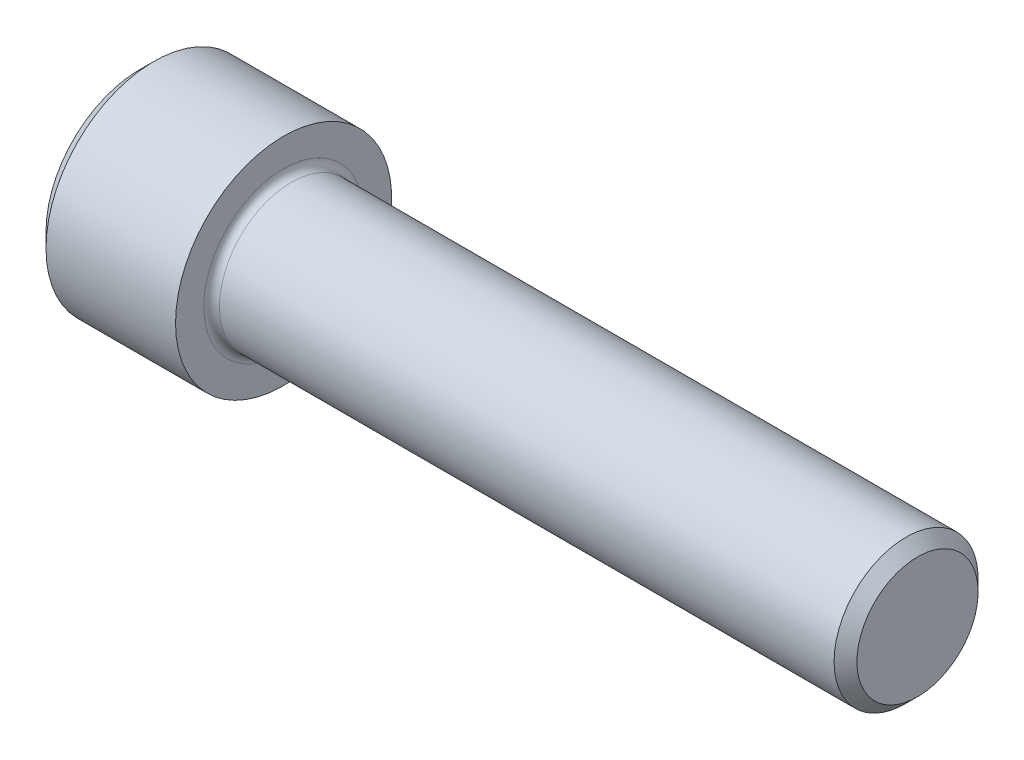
ISO-10303-21;
HEADER;
FILE_DESCRIPTION(('STEP AP214'),'2;1');
FILE_NAME('part.step','',(''),(''),'','','');
FILE_SCHEMA(('AUTOMOTIVE_DESIGN { 1 0 10303 214 1 1 1 1 }'));
ENDSEC;
DATA;
#1=APPLICATION_CONTEXT('core data for automotive mechanical design processes');
#2=APPLICATION_PROTOCOL_DEFINITION('international standard','automotive_design',2000,#1);
#3=PRODUCT_CONTEXT('',#1,'mechanical');
#4=PRODUCT('Part','Part','',(#3));
#5=PRODUCT_RELATED_PRODUCT_CATEGORY('part','',(#4));
#6=PRODUCT_DEFINITION_FORMATION('','',#4);
#7=PRODUCT_DEFINITION_CONTEXT('part definition',#1,'design');
#8=PRODUCT_DEFINITION('design','',#6,#7);
#9=PRODUCT_DEFINITION_SHAPE('','',#8);
#10=(LENGTH_UNIT() NAMED_UNIT(*) SI_UNIT(.MILLI.,.METRE.));
#11=(NAMED_UNIT(*) PLANE_ANGLE_UNIT() SI_UNIT($,.RADIAN.));
#12=(NAMED_UNIT(*) SI_UNIT($,.STERADIAN.) SOLID_ANGLE_UNIT());
#13=UNCERTAINTY_MEASURE_WITH_UNIT(LENGTH_MEASURE(1.E-05),#10,'distance_accuracy_value','');
#14=(GEOMETRIC_REPRESENTATION_CONTEXT(3) GLOBAL_UNCERTAINTY_ASSIGNED_CONTEXT((#13)) GLOBAL_UNIT_ASSIGNED_CONTEXT((#10,
#11,#12)) REPRESENTATION_CONTEXT('',''));
#15=CARTESIAN_POINT('',(0.,0.,0.));
#16=DIRECTION('',(0.,0.,1.));
#17=DIRECTION('',(1.,0.,0.));
#18=AXIS2_PLACEMENT_3D('',#15,#16,#17);
#19=CARTESIAN_POINT('',(0.,0.,0.));
#20=DIRECTION('',(-1.,0.,0.));
#21=DIRECTION('',(0.,0.,1.));
#22=AXIS2_PLACEMENT_3D('',#19,#20,#21);
#23=PLANE('',#22);
#24=DIRECTION('',(0.,-0.499999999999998,0.86602540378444));
#25=VECTOR('',#24,1.);
#26=CARTESIAN_POINT('',(0.,3.66617420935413,0.));
#27=LINE('',#26,#25);
#28=CARTESIAN_POINT('',(0.,3.66617420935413,0.));
#29=VERTEX_POINT('',#28);
#30=CARTESIAN_POINT('',(0.,1.83308710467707,3.17499999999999));
#31=VERTEX_POINT('',#30);
#32=EDGE_CURVE('E256',#29,#31,#27,.T.);
#33=ORIENTED_EDGE('',*,*,#32,.T.);
#34=DIRECTION('',(0.,1.,0.));
#35=VECTOR('',#34,1.);
#36=CARTESIAN_POINT('',(0.,-1.83308710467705,3.175));
#37=LINE('',#36,#35);
#38=CARTESIAN_POINT('',(0.,-1.83308710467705,3.175));
#39=VERTEX_POINT('',#38);
#40=EDGE_CURVE('E127',#39,#31,#37,.T.);
#41=ORIENTED_EDGE('',*,*,#40,.F.);
#42=DIRECTION('',(0.,-0.500000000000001,-0.866025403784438));
#43=VECTOR('',#42,1.);
#44=CARTESIAN_POINT('',(0.,-1.83308710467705,3.175));
#45=LINE('',#44,#43);
#46=CARTESIAN_POINT('',(0.,-3.66617420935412,0.));
#47=VERTEX_POINT('',#46);
#48=EDGE_CURVE('E259',#39,#47,#45,.T.);
#49=ORIENTED_EDGE('',*,*,#48,.T.);
#50=DIRECTION('',(0.,0.499999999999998,-0.86602540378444));
#51=VECTOR('',#50,1.);
#52=CARTESIAN_POINT('',(0.,-3.66617420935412,0.));
#53=LINE('',#52,#51);
#54=CARTESIAN_POINT('',(0.,-1.83308710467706,-3.175));
#55=VERTEX_POINT('',#54);
#56=EDGE_CURVE('E262',#47,#55,#53,.T.);
#57=ORIENTED_EDGE('',*,*,#56,.T.);
#58=DIRECTION('',(0.,-1.,0.));
#59=VECTOR('',#58,1.);
#60=CARTESIAN_POINT('',(0.,1.83308710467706,-3.175));
#61=LINE('',#60,#59);
#62=CARTESIAN_POINT('',(0.,1.83308710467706,-3.175));
#63=VERTEX_POINT('',#62);
#64=EDGE_CURVE('E265',#63,#55,#61,.T.);
#65=ORIENTED_EDGE('',*,*,#64,.F.);
#66=DIRECTION('',(0.,-0.500000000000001,-0.866025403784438));
#67=VECTOR('',#66,1.);
#68=CARTESIAN_POINT('',(0.,3.66617420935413,0.));
#69=LINE('',#68,#67);
#70=EDGE_CURVE('E122',#29,#63,#69,.T.);
#71=ORIENTED_EDGE('',*,*,#70,.F.);
#72=EDGE_LOOP('',(#33,#41,#49,#57,#65,#71));
#73=FACE_BOUND('',#72,.T.);
#74=CARTESIAN_POINT('',(0.,0.,0.));
#75=DIRECTION('',(-1.,0.,0.));
#76=DIRECTION('',(0.,0.,1.));
#77=AXIS2_PLACEMENT_3D('',#74,#75,#76);
#78=CIRCLE('',#77,5.15366);
#79=CARTESIAN_POINT('',(0.,0.,5.15366));
#80=VERTEX_POINT('',#79);
#81=EDGE_CURVE('E151',#80,#80,#78,.T.);
#82=ORIENTED_EDGE('',*,*,#81,.T.);
#83=EDGE_LOOP('',(#82));
#84=FACE_BOUND('',#83,.T.);
#85=ADVANCED_FACE('F31',(#73,#84),#23,.T.);
#86=CARTESIAN_POINT('',(0.,0.,0.));
#87=DIRECTION('',(1.,0.,0.));
#88=DIRECTION('',(0.,0.,-1.));
#89=AXIS2_PLACEMENT_3D('',#86,#87,#88);
#90=CONICAL_SURFACE('',#89,5.15366,0.785398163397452);
#91=CARTESIAN_POINT('',(0.800099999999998,0.,0.));
#92=DIRECTION('',(-1.,0.,0.));
#93=DIRECTION('',(0.,0.,1.));
#94=AXIS2_PLACEMENT_3D('',#91,#92,#93);
#95=CIRCLE('',#94,5.95376);
#96=CARTESIAN_POINT('',(0.800099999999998,0.,5.95376));
#97=VERTEX_POINT('',#96);
#98=EDGE_CURVE('E148',#97,#97,#95,.T.);
#99=ORIENTED_EDGE('',*,*,#98,.T.);
#100=EDGE_LOOP('',(#99));
#101=FACE_BOUND('',#100,.T.);
#102=ORIENTED_EDGE('',*,*,#81,.F.);
#103=EDGE_LOOP('',(#102));
#104=FACE_BOUND('',#103,.T.);
#105=ADVANCED_FACE('F172',(#101,#104),#90,.T.);
#106=CARTESIAN_POINT('',(-31.75,0.,0.));
#107=DIRECTION('',(-1.,0.,0.));
#108=DIRECTION('',(0.,0.,1.));
#109=AXIS2_PLACEMENT_3D('',#106,#107,#108);
#110=CYLINDRICAL_SURFACE('',#109,5.95376);
#111=CARTESIAN_POINT('',(7.9375,0.,0.));
#112=DIRECTION('',(-1.,0.,0.));
#113=DIRECTION('',(0.,0.,1.));
#114=AXIS2_PLACEMENT_3D('',#111,#112,#113);
#115=CIRCLE('',#114,5.95376);
#116=CARTESIAN_POINT('',(7.9375,0.,5.95376));
#117=VERTEX_POINT('',#116);
#118=EDGE_CURVE('E145',#117,#117,#115,.T.);
#119=ORIENTED_EDGE('',*,*,#118,.T.);
#120=EDGE_LOOP('',(#119));
#121=FACE_BOUND('',#120,.T.);
#122=ORIENTED_EDGE('',*,*,#98,.F.);
#123=EDGE_LOOP('',(#122));
#124=FACE_BOUND('',#123,.T.);
#125=ADVANCED_FACE('F177',(#121,#124),#110,.T.);
#126=CARTESIAN_POINT('',(7.9375,5.95376,0.));
#127=DIRECTION('',(1.,0.,0.));
#128=DIRECTION('',(0.,0.,-1.));
#129=AXIS2_PLACEMENT_3D('',#126,#127,#128);
#130=PLANE('',#129);
#131=CARTESIAN_POINT('',(7.9375,0.,0.));
#132=DIRECTION('',(1.,0.,0.));
#133=DIRECTION('',(0.,0.,-1.));
#134=AXIS2_PLACEMENT_3D('',#131,#132,#133);
#135=CIRCLE('',#134,4.40055);
#136=CARTESIAN_POINT('',(7.9375,0.,-4.40055));
#137=VERTEX_POINT('',#136);
#138=EDGE_CURVE('E39',#137,#137,#135,.F.);
#139=ORIENTED_EDGE('',*,*,#138,.T.);
#140=EDGE_LOOP('',(#139));
#141=FACE_BOUND('',#140,.T.);
#142=ORIENTED_EDGE('',*,*,#118,.F.);
#143=EDGE_LOOP('',(#142));
#144=FACE_BOUND('',#143,.T.);
#145=ADVANCED_FACE('F156',(#141,#144),#130,.T.);
#146=CARTESIAN_POINT('',(-31.75,0.,0.));
#147=DIRECTION('',(-1.,0.,0.));
#148=DIRECTION('',(0.,0.,1.));
#149=AXIS2_PLACEMENT_3D('',#146,#147,#148);
#150=CYLINDRICAL_SURFACE('',#149,3.96875);
#151=CARTESIAN_POINT('',(8.3693,0.,0.));
#152=DIRECTION('',(1.,0.,0.));
#153=DIRECTION('',(0.,0.,-1.));
#154=AXIS2_PLACEMENT_3D('',#151,#152,#153);
#155=CIRCLE('',#154,3.96875);
#156=CARTESIAN_POINT('',(8.3693,0.,-3.96875));
#157=VERTEX_POINT('',#156);
#158=EDGE_CURVE('E11',#157,#157,#155,.T.);
#159=ORIENTED_EDGE('',*,*,#158,.T.);
#160=EDGE_LOOP('',(#159));
#161=FACE_BOUND('',#160,.T.);
#162=CARTESIAN_POINT('',(42.23258,0.,0.));
#163=DIRECTION('',(-1.,0.,0.));
#164=DIRECTION('',(0.,0.,1.));
#165=AXIS2_PLACEMENT_3D('',#162,#163,#164);
#166=CIRCLE('',#165,3.96875);
#167=CARTESIAN_POINT('',(42.23258,0.,3.96875));
#168=VERTEX_POINT('',#167);
#169=EDGE_CURVE('E142',#168,#168,#166,.T.);
#170=ORIENTED_EDGE('',*,*,#169,.T.);
#171=EDGE_LOOP('',(#170));
#172=FACE_BOUND('',#171,.T.);
#173=ADVANCED_FACE('F187',(#161,#172),#150,.T.);
#174=CARTESIAN_POINT('',(42.8625,0.,0.));
#175=DIRECTION('',(-1.,0.,0.));
#176=DIRECTION('',(0.,0.,1.));
#177=AXIS2_PLACEMENT_3D('',#174,#175,#176);
#178=CONICAL_SURFACE('',#177,3.33883,0.785398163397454);
#179=ORIENTED_EDGE('',*,*,#169,.F.);
#180=EDGE_LOOP('',(#179));
#181=FACE_BOUND('',#180,.T.);
#182=CARTESIAN_POINT('',(42.8625,0.,0.));
#183=DIRECTION('',(-1.,0.,0.));
#184=DIRECTION('',(0.,0.,1.));
#185=AXIS2_PLACEMENT_3D('',#182,#183,#184);
#186=CIRCLE('',#185,3.33883);
#187=CARTESIAN_POINT('',(42.8625,0.,3.33883));
#188=VERTEX_POINT('',#187);
#189=EDGE_CURVE('E138',#188,#188,#186,.T.);
#190=ORIENTED_EDGE('',*,*,#189,.T.);
#191=EDGE_LOOP('',(#190));
#192=FACE_BOUND('',#191,.T.);
#193=ADVANCED_FACE('F167',(#181,#192),#178,.T.);
#194=CARTESIAN_POINT('',(42.8625,3.33883,0.));
#195=DIRECTION('',(1.,0.,0.));
#196=DIRECTION('',(0.,0.,-1.));
#197=AXIS2_PLACEMENT_3D('',#194,#195,#196);
#198=PLANE('',#197);
#199=ORIENTED_EDGE('',*,*,#189,.F.);
#200=EDGE_LOOP('',(#199));
#201=FACE_BOUND('',#200,.T.);
#202=ADVANCED_FACE('F160',(#201),#198,.T.);
#203=CARTESIAN_POINT('',(8.3693,0.,0.));
#204=DIRECTION('',(1.,0.,0.));
#205=DIRECTION('',(0.,0.,-1.));
#206=AXIS2_PLACEMENT_3D('',#203,#204,#205);
#207=TOROIDAL_SURFACE('',#206,4.40055,0.4318);
#208=ORIENTED_EDGE('',*,*,#158,.F.);
#209=EDGE_LOOP('',(#208));
#210=FACE_BOUND('',#209,.T.);
#211=ORIENTED_EDGE('',*,*,#138,.F.);
#212=EDGE_LOOP('',(#211));
#213=FACE_BOUND('',#212,.T.);
#214=ADVANCED_FACE('F33',(#210,#213),#207,.F.);
#215=CARTESIAN_POINT('',(3.8354,3.66617420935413,0.));
#216=DIRECTION('',(0.,-0.86602540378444,-0.499999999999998));
#217=DIRECTION('',(0.,0.499999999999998,-0.86602540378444));
#218=AXIS2_PLACEMENT_3D('',#215,#216,#217);
#219=PLANE('',#218);
#220=ORIENTED_EDGE('',*,*,#32,.F.);
#221=DIRECTION('',(-1.,0.,0.));
#222=VECTOR('',#221,1.);
#223=CARTESIAN_POINT('',(3.8354,3.66617420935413,0.));
#224=LINE('',#223,#222);
#225=CARTESIAN_POINT('',(3.8354,3.66617420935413,0.));
#226=VERTEX_POINT('',#225);
#227=EDGE_CURVE('E246',#226,#29,#224,.T.);
#228=ORIENTED_EDGE('',*,*,#227,.F.);
#229=DIRECTION('',(0.,-0.499999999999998,0.86602540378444));
#230=VECTOR('',#229,1.);
#231=CARTESIAN_POINT('',(3.8354,3.66617420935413,0.));
#232=LINE('',#231,#230);
#233=CARTESIAN_POINT('',(3.8354,2.7496306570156,1.5875));
#234=VERTEX_POINT('',#233);
#235=EDGE_CURVE('E114',#226,#234,#232,.T.);
#236=ORIENTED_EDGE('',*,*,#235,.T.);
#237=CARTESIAN_POINT('',(3.8354,1.83308710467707,3.17499999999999));
#238=VERTEX_POINT('',#237);
#239=EDGE_CURVE('E105',#234,#238,#232,.T.);
#240=ORIENTED_EDGE('',*,*,#239,.T.);
#241=DIRECTION('',(-1.,0.,0.));
#242=VECTOR('',#241,1.);
#243=CARTESIAN_POINT('',(3.8354,1.83308710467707,3.17499999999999));
#244=LINE('',#243,#242);
#245=EDGE_CURVE('E119',#238,#31,#244,.T.);
#246=ORIENTED_EDGE('',*,*,#245,.T.);
#247=EDGE_LOOP('',(#220,#228,#236,#240,#246));
#248=FACE_BOUND('',#247,.T.);
#249=ADVANCED_FACE('F118',(#248),#219,.T.);
#250=CARTESIAN_POINT('',(3.8354,-1.83308710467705,3.175));
#251=DIRECTION('',(0.,0.,1.));
#252=DIRECTION('',(0.,-1.,0.));
#253=AXIS2_PLACEMENT_3D('',#250,#251,#252);
#254=PLANE('',#253);
#255=ORIENTED_EDGE('',*,*,#40,.T.);
#256=ORIENTED_EDGE('',*,*,#245,.F.);
#257=DIRECTION('',(0.,1.,0.));
#258=VECTOR('',#257,1.);
#259=CARTESIAN_POINT('',(3.8354,-1.83308710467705,3.175));
#260=LINE('',#259,#258);
#261=CARTESIAN_POINT('',(3.8354,0.,3.175));
#262=VERTEX_POINT('',#261);
#263=EDGE_CURVE('E102',#262,#238,#260,.T.);
#264=ORIENTED_EDGE('',*,*,#263,.F.);
#265=CARTESIAN_POINT('',(3.8354,-1.83308710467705,3.175));
#266=VERTEX_POINT('',#265);
#267=EDGE_CURVE('E113',#266,#262,#260,.T.);
#268=ORIENTED_EDGE('',*,*,#267,.F.);
#269=DIRECTION('',(-1.,0.,0.));
#270=VECTOR('',#269,1.);
#271=CARTESIAN_POINT('',(3.8354,-1.83308710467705,3.175));
#272=LINE('',#271,#270);
#273=EDGE_CURVE('E129',#266,#39,#272,.T.);
#274=ORIENTED_EDGE('',*,*,#273,.T.);
#275=EDGE_LOOP('',(#255,#256,#264,#268,#274));
#276=FACE_BOUND('',#275,.T.);
#277=ADVANCED_FACE('F124',(#276),#254,.F.);
#278=CARTESIAN_POINT('',(3.8354,-1.83308710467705,3.175));
#279=DIRECTION('',(0.,0.866025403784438,-0.500000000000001));
#280=DIRECTION('',(0.,0.500000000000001,0.866025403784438));
#281=AXIS2_PLACEMENT_3D('',#278,#279,#280);
#282=PLANE('',#281);
#283=ORIENTED_EDGE('',*,*,#48,.F.);
#284=ORIENTED_EDGE('',*,*,#273,.F.);
#285=DIRECTION('',(0.,-0.500000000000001,-0.866025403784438));
#286=VECTOR('',#285,1.);
#287=CARTESIAN_POINT('',(3.8354,-1.83308710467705,3.175));
#288=LINE('',#287,#286);
#289=CARTESIAN_POINT('',(3.8354,-2.74963065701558,1.5875));
#290=VERTEX_POINT('',#289);
#291=EDGE_CURVE('E285',#266,#290,#288,.T.);
#292=ORIENTED_EDGE('',*,*,#291,.T.);
#293=CARTESIAN_POINT('',(3.8354,-3.66617420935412,0.));
#294=VERTEX_POINT('',#293);
#295=EDGE_CURVE('E274',#290,#294,#288,.T.);
#296=ORIENTED_EDGE('',*,*,#295,.T.);
#297=DIRECTION('',(-1.,0.,0.));
#298=VECTOR('',#297,1.);
#299=CARTESIAN_POINT('',(3.8354,-3.66617420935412,0.));
#300=LINE('',#299,#298);
#301=EDGE_CURVE('E134',#294,#47,#300,.T.);
#302=ORIENTED_EDGE('',*,*,#301,.T.);
#303=EDGE_LOOP('',(#283,#284,#292,#296,#302));
#304=FACE_BOUND('',#303,.T.);
#305=ADVANCED_FACE('F200',(#304),#282,.T.);
#306=CARTESIAN_POINT('',(3.8354,-3.66617420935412,0.));
#307=DIRECTION('',(0.,0.86602540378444,0.499999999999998));
#308=DIRECTION('',(0.,-0.499999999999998,0.86602540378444));
#309=AXIS2_PLACEMENT_3D('',#306,#307,#308);
#310=PLANE('',#309);
#311=ORIENTED_EDGE('',*,*,#56,.F.);
#312=ORIENTED_EDGE('',*,*,#301,.F.);
#313=DIRECTION('',(0.,0.499999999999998,-0.86602540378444));
#314=VECTOR('',#313,1.);
#315=CARTESIAN_POINT('',(3.8354,-3.66617420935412,0.));
#316=LINE('',#315,#314);
#317=CARTESIAN_POINT('',(3.8354,-2.74963065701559,-1.58749999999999));
#318=VERTEX_POINT('',#317);
#319=EDGE_CURVE('E252',#294,#318,#316,.T.);
#320=ORIENTED_EDGE('',*,*,#319,.T.);
#321=CARTESIAN_POINT('',(3.8354,-1.83308710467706,-3.175));
#322=VERTEX_POINT('',#321);
#323=EDGE_CURVE('E284',#318,#322,#316,.T.);
#324=ORIENTED_EDGE('',*,*,#323,.T.);
#325=DIRECTION('',(-1.,0.,0.));
#326=VECTOR('',#325,1.);
#327=CARTESIAN_POINT('',(3.8354,-1.83308710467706,-3.175));
#328=LINE('',#327,#326);
#329=EDGE_CURVE('E245',#322,#55,#328,.T.);
#330=ORIENTED_EDGE('',*,*,#329,.T.);
#331=EDGE_LOOP('',(#311,#312,#320,#324,#330));
#332=FACE_BOUND('',#331,.T.);
#333=ADVANCED_FACE('F203',(#332),#310,.T.);
#334=CARTESIAN_POINT('',(3.8354,1.83308710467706,-3.175));
#335=DIRECTION('',(0.,0.,-1.));
#336=DIRECTION('',(0.,1.,0.));
#337=AXIS2_PLACEMENT_3D('',#334,#335,#336);
#338=PLANE('',#337);
#339=ORIENTED_EDGE('',*,*,#64,.T.);
#340=ORIENTED_EDGE('',*,*,#329,.F.);
#341=DIRECTION('',(0.,-1.,0.));
#342=VECTOR('',#341,1.);
#343=CARTESIAN_POINT('',(3.8354,1.83308710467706,-3.175));
#344=LINE('',#343,#342);
#345=CARTESIAN_POINT('',(3.8354,0.,-3.175));
#346=VERTEX_POINT('',#345);
#347=EDGE_CURVE('E249',#346,#322,#344,.T.);
#348=ORIENTED_EDGE('',*,*,#347,.F.);
#349=CARTESIAN_POINT('',(3.8354,1.83308710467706,-3.175));
#350=VERTEX_POINT('',#349);
#351=EDGE_CURVE('E46',#350,#346,#344,.T.);
#352=ORIENTED_EDGE('',*,*,#351,.F.);
#353=DIRECTION('',(-1.,0.,0.));
#354=VECTOR('',#353,1.);
#355=CARTESIAN_POINT('',(3.8354,1.83308710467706,-3.175));
#356=LINE('',#355,#354);
#357=EDGE_CURVE('E242',#350,#63,#356,.T.);
#358=ORIENTED_EDGE('',*,*,#357,.T.);
#359=EDGE_LOOP('',(#339,#340,#348,#352,#358));
#360=FACE_BOUND('',#359,.T.);
#361=ADVANCED_FACE('F207',(#360),#338,.F.);
#362=CARTESIAN_POINT('',(3.8354,3.66617420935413,0.));
#363=DIRECTION('',(0.,0.866025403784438,-0.500000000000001));
#364=DIRECTION('',(0.,0.500000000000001,0.866025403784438));
#365=AXIS2_PLACEMENT_3D('',#362,#363,#364);
#366=PLANE('',#365);
#367=ORIENTED_EDGE('',*,*,#70,.T.);
#368=ORIENTED_EDGE('',*,*,#357,.F.);
#369=DIRECTION('',(0.,-0.500000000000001,-0.866025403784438));
#370=VECTOR('',#369,1.);
#371=CARTESIAN_POINT('',(3.8354,3.66617420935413,0.));
#372=LINE('',#371,#370);
#373=CARTESIAN_POINT('',(3.8354,2.7496306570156,-1.58750000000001));
#374=VERTEX_POINT('',#373);
#375=EDGE_CURVE('E232',#374,#350,#372,.T.);
#376=ORIENTED_EDGE('',*,*,#375,.F.);
#377=EDGE_CURVE('E238',#226,#374,#372,.T.);
#378=ORIENTED_EDGE('',*,*,#377,.F.);
#379=ORIENTED_EDGE('',*,*,#227,.T.);
#380=EDGE_LOOP('',(#367,#368,#376,#378,#379));
#381=FACE_BOUND('',#380,.T.);
#382=ADVANCED_FACE('F211',(#381),#366,.F.);
#383=CARTESIAN_POINT('',(3.8354,5.49926131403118,-3.17500000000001));
#384=DIRECTION('',(1.,0.,0.));
#385=DIRECTION('',(0.,0.,-1.));
#386=AXIS2_PLACEMENT_3D('',#383,#384,#385);
#387=PLANE('',#386);
#388=ORIENTED_EDGE('',*,*,#347,.T.);
#389=ORIENTED_EDGE('',*,*,#323,.F.);
#390=CARTESIAN_POINT('',(3.8354,0.,0.));
#391=DIRECTION('',(-1.,0.,0.));
#392=DIRECTION('',(0.,0.,1.));
#393=AXIS2_PLACEMENT_3D('',#390,#391,#392);
#394=CIRCLE('',#393,3.175);
#395=EDGE_CURVE('E280',#346,#318,#394,.T.);
#396=ORIENTED_EDGE('',*,*,#395,.F.);
#397=EDGE_LOOP('',(#388,#389,#396));
#398=FACE_BOUND('',#397,.T.);
#399=ADVANCED_FACE('F215',(#398),#387,.F.);
#400=ORIENTED_EDGE('',*,*,#319,.F.);
#401=ORIENTED_EDGE('',*,*,#295,.F.);
#402=EDGE_CURVE('E132',#318,#290,#394,.T.);
#403=ORIENTED_EDGE('',*,*,#402,.F.);
#404=EDGE_LOOP('',(#400,#401,#403));
#405=FACE_BOUND('',#404,.T.);
#406=ADVANCED_FACE('F218',(#405),#387,.F.);
#407=ORIENTED_EDGE('',*,*,#291,.F.);
#408=ORIENTED_EDGE('',*,*,#267,.T.);
#409=EDGE_CURVE('E128',#290,#262,#394,.T.);
#410=ORIENTED_EDGE('',*,*,#409,.F.);
#411=EDGE_LOOP('',(#407,#408,#410));
#412=FACE_BOUND('',#411,.T.);
#413=ADVANCED_FACE('F223',(#412),#387,.F.);
#414=ORIENTED_EDGE('',*,*,#263,.T.);
#415=ORIENTED_EDGE('',*,*,#239,.F.);
#416=EDGE_CURVE('E108',#262,#234,#394,.T.);
#417=ORIENTED_EDGE('',*,*,#416,.F.);
#418=EDGE_LOOP('',(#414,#415,#417));
#419=FACE_BOUND('',#418,.T.);
#420=ADVANCED_FACE('F104',(#419),#387,.F.);
#421=ORIENTED_EDGE('',*,*,#235,.F.);
#422=ORIENTED_EDGE('',*,*,#377,.T.);
#423=EDGE_CURVE('E139',#234,#374,#394,.T.);
#424=ORIENTED_EDGE('',*,*,#423,.F.);
#425=EDGE_LOOP('',(#421,#422,#424));
#426=FACE_BOUND('',#425,.T.);
#427=ADVANCED_FACE('F226',(#426),#387,.F.);
#428=ORIENTED_EDGE('',*,*,#375,.T.);
#429=ORIENTED_EDGE('',*,*,#351,.T.);
#430=EDGE_CURVE('E235',#374,#346,#394,.T.);
#431=ORIENTED_EDGE('',*,*,#430,.F.);
#432=EDGE_LOOP('',(#428,#429,#431));
#433=FACE_BOUND('',#432,.T.);
#434=ADVANCED_FACE('F196',(#433),#387,.F.);
#435=CARTESIAN_POINT('',(3.8354,0.,0.));
#436=DIRECTION('',(-1.,0.,0.));
#437=DIRECTION('',(0.,0.,1.));
#438=AXIS2_PLACEMENT_3D('',#435,#436,#437);
#439=CONICAL_SURFACE('',#438,3.175,1.04719755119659);
#440=CARTESIAN_POINT('',(5.66848710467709,0.,0.));
#441=VERTEX_POINT('',#440);
#442=VERTEX_LOOP('',#441);
#443=FACE_BOUND('',#442,.T.);
#444=ORIENTED_EDGE('',*,*,#416,.T.);
#445=ORIENTED_EDGE('',*,*,#423,.T.);
#446=ORIENTED_EDGE('',*,*,#430,.T.);
#447=ORIENTED_EDGE('',*,*,#395,.T.);
#448=ORIENTED_EDGE('',*,*,#402,.T.);
#449=ORIENTED_EDGE('',*,*,#409,.T.);
#450=EDGE_LOOP('',(#444,#445,#446,#447,#448,#449));
#451=FACE_BOUND('',#450,.T.);
#452=ADVANCED_FACE('F194',(#443,#451),#439,.F.);
#453=CLOSED_SHELL('',(#85,#105,#125,#145,#173,#193,#202,#214,#249,#277,#305,#333,#361,#382,#399,
#406,#413,#420,#427,#434,#452));
#454=MANIFOLD_SOLID_BREP('B2',#453);
#455=ADVANCED_BREP_SHAPE_REPRESENTATION('',(#18,#454),#14);
#456=SHAPE_DEFINITION_REPRESENTATION(#9,#455);
ENDSEC;
END-ISO-10303-21;
